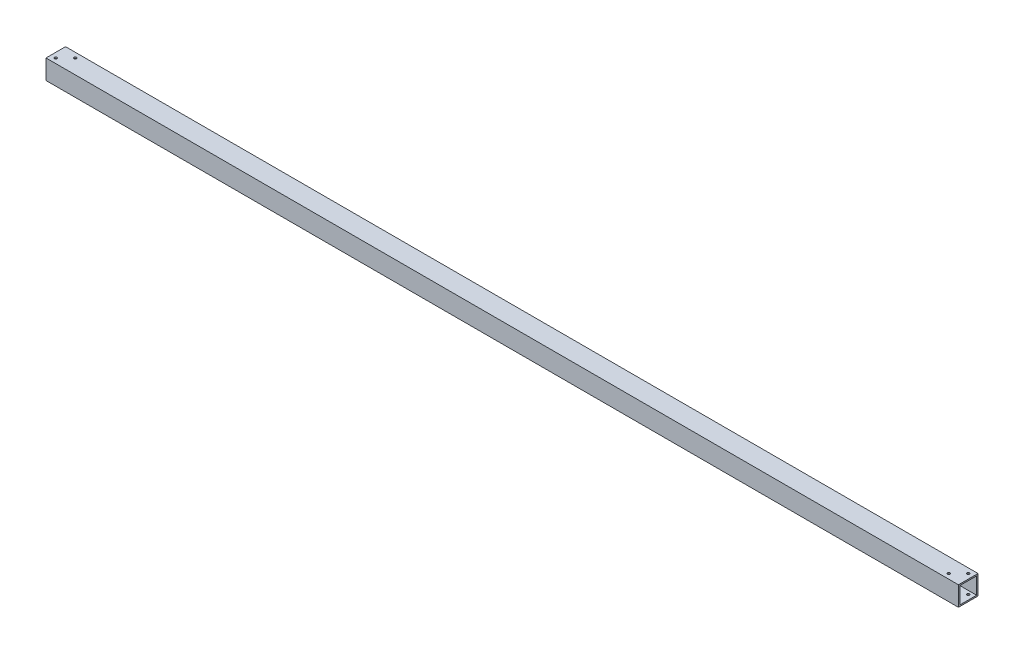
ISO-10303-21;
HEADER;
FILE_DESCRIPTION(('STEP AP214'),'2;1');
FILE_NAME('part.step','',(''),(''),'','','');
FILE_SCHEMA(('AUTOMOTIVE_DESIGN { 1 0 10303 214 1 1 1 1 }'));
ENDSEC;
DATA;
#1=APPLICATION_CONTEXT('core data for automotive mechanical design processes');
#2=APPLICATION_PROTOCOL_DEFINITION('international standard','automotive_design',2000,#1);
#3=PRODUCT_CONTEXT('',#1,'mechanical');
#4=PRODUCT('Part','Part','',(#3));
#5=PRODUCT_RELATED_PRODUCT_CATEGORY('part','',(#4));
#6=PRODUCT_DEFINITION_FORMATION('','',#4);
#7=PRODUCT_DEFINITION_CONTEXT('part definition',#1,'design');
#8=PRODUCT_DEFINITION('design','',#6,#7);
#9=PRODUCT_DEFINITION_SHAPE('','',#8);
#10=(LENGTH_UNIT() NAMED_UNIT(*) SI_UNIT(.MILLI.,.METRE.));
#11=(NAMED_UNIT(*) PLANE_ANGLE_UNIT() SI_UNIT($,.RADIAN.));
#12=(NAMED_UNIT(*) SI_UNIT($,.STERADIAN.) SOLID_ANGLE_UNIT());
#13=UNCERTAINTY_MEASURE_WITH_UNIT(LENGTH_MEASURE(1.E-05),#10,'distance_accuracy_value','');
#14=(GEOMETRIC_REPRESENTATION_CONTEXT(3) GLOBAL_UNCERTAINTY_ASSIGNED_CONTEXT((#13)) GLOBAL_UNIT_ASSIGNED_CONTEXT((#10,
#11,#12)) REPRESENTATION_CONTEXT('',''));
#15=CARTESIAN_POINT('',(0.,0.,0.));
#16=DIRECTION('',(0.,0.,1.));
#17=DIRECTION('',(1.,0.,0.));
#18=AXIS2_PLACEMENT_3D('',#15,#16,#17);
#19=CARTESIAN_POINT('',(2370.582,50.8,0.));
#20=DIRECTION('',(-1.,0.,0.));
#21=DIRECTION('',(0.,0.,1.));
#22=AXIS2_PLACEMENT_3D('',#19,#20,#21);
#23=PLANE('',#22);
#24=DIRECTION('',(0.,-1.,0.));
#25=VECTOR('',#24,1.);
#26=CARTESIAN_POINT('',(2370.582,0.,0.));
#27=LINE('',#26,#25);
#28=CARTESIAN_POINT('',(2370.582,50.8,0.));
#29=VERTEX_POINT('',#28);
#30=CARTESIAN_POINT('',(2370.582,0.,0.));
#31=VERTEX_POINT('',#30);
#32=EDGE_CURVE('E135',#29,#31,#27,.T.);
#33=ORIENTED_EDGE('',*,*,#32,.T.);
#34=DIRECTION('',(0.,0.,-1.));
#35=VECTOR('',#34,1.);
#36=CARTESIAN_POINT('',(2370.582,0.,0.));
#37=LINE('',#36,#35);
#38=CARTESIAN_POINT('',(2370.582,0.,-50.8));
#39=VERTEX_POINT('',#38);
#40=EDGE_CURVE('E138',#31,#39,#37,.T.);
#41=ORIENTED_EDGE('',*,*,#40,.T.);
#42=DIRECTION('',(0.,1.,0.));
#43=VECTOR('',#42,1.);
#44=CARTESIAN_POINT('',(2370.582,0.,-50.8));
#45=LINE('',#44,#43);
#46=CARTESIAN_POINT('',(2370.582,50.8,-50.8));
#47=VERTEX_POINT('',#46);
#48=EDGE_CURVE('E141',#39,#47,#45,.T.);
#49=ORIENTED_EDGE('',*,*,#48,.T.);
#50=DIRECTION('',(0.,0.,1.));
#51=VECTOR('',#50,1.);
#52=CARTESIAN_POINT('',(2370.582,50.8,0.));
#53=LINE('',#52,#51);
#54=EDGE_CURVE('E143',#47,#29,#53,.T.);
#55=ORIENTED_EDGE('',*,*,#54,.T.);
#56=EDGE_LOOP('',(#33,#41,#49,#55));
#57=FACE_BOUND('',#56,.T.);
#58=DIRECTION('',(0.,-1.,0.));
#59=VECTOR('',#58,1.);
#60=CARTESIAN_POINT('',(2370.582,47.1424,-3.6576));
#61=LINE('',#60,#59);
#62=CARTESIAN_POINT('',(2370.582,47.1424,-3.6576));
#63=VERTEX_POINT('',#62);
#64=CARTESIAN_POINT('',(2370.582,3.6576,-3.6576));
#65=VERTEX_POINT('',#64);
#66=EDGE_CURVE('E97',#63,#65,#61,.T.);
#67=ORIENTED_EDGE('',*,*,#66,.F.);
#68=DIRECTION('',(0.,0.,1.));
#69=VECTOR('',#68,1.);
#70=CARTESIAN_POINT('',(2370.582,47.1424,-3.6576));
#71=LINE('',#70,#69);
#72=CARTESIAN_POINT('',(2370.582,47.1424,-47.1424));
#73=VERTEX_POINT('',#72);
#74=EDGE_CURVE('E119',#73,#63,#71,.T.);
#75=ORIENTED_EDGE('',*,*,#74,.F.);
#76=DIRECTION('',(0.,1.,0.));
#77=VECTOR('',#76,1.);
#78=CARTESIAN_POINT('',(2370.582,47.1424,-47.1424));
#79=LINE('',#78,#77);
#80=CARTESIAN_POINT('',(2370.582,3.6576,-47.1424));
#81=VERTEX_POINT('',#80);
#82=EDGE_CURVE('E117',#81,#73,#79,.T.);
#83=ORIENTED_EDGE('',*,*,#82,.F.);
#84=DIRECTION('',(0.,0.,-1.));
#85=VECTOR('',#84,1.);
#86=CARTESIAN_POINT('',(2370.582,3.6576,-3.6576));
#87=LINE('',#86,#85);
#88=EDGE_CURVE('E105',#65,#81,#87,.T.);
#89=ORIENTED_EDGE('',*,*,#88,.F.);
#90=EDGE_LOOP('',(#67,#75,#83,#89));
#91=FACE_BOUND('',#90,.T.);
#92=ADVANCED_FACE('F30',(#57,#91),#23,.F.);
#93=CARTESIAN_POINT('',(0.,50.8,0.));
#94=DIRECTION('',(-1.,0.,0.));
#95=DIRECTION('',(0.,0.,1.));
#96=AXIS2_PLACEMENT_3D('',#93,#94,#95);
#97=PLANE('',#96);
#98=DIRECTION('',(0.,-1.,0.));
#99=VECTOR('',#98,1.);
#100=CARTESIAN_POINT('',(0.,0.,0.));
#101=LINE('',#100,#99);
#102=CARTESIAN_POINT('',(0.,50.8,0.));
#103=VERTEX_POINT('',#102);
#104=CARTESIAN_POINT('',(0.,0.,0.));
#105=VERTEX_POINT('',#104);
#106=EDGE_CURVE('E113',#103,#105,#101,.T.);
#107=ORIENTED_EDGE('',*,*,#106,.F.);
#108=DIRECTION('',(0.,0.,1.));
#109=VECTOR('',#108,1.);
#110=CARTESIAN_POINT('',(0.,50.8,0.));
#111=LINE('',#110,#109);
#112=CARTESIAN_POINT('',(0.,50.8,-50.8));
#113=VERTEX_POINT('',#112);
#114=EDGE_CURVE('E139',#113,#103,#111,.T.);
#115=ORIENTED_EDGE('',*,*,#114,.F.);
#116=DIRECTION('',(0.,1.,0.));
#117=VECTOR('',#116,1.);
#118=CARTESIAN_POINT('',(0.,0.,-50.8));
#119=LINE('',#118,#117);
#120=CARTESIAN_POINT('',(0.,0.,-50.8));
#121=VERTEX_POINT('',#120);
#122=EDGE_CURVE('E150',#121,#113,#119,.T.);
#123=ORIENTED_EDGE('',*,*,#122,.F.);
#124=DIRECTION('',(0.,0.,-1.));
#125=VECTOR('',#124,1.);
#126=CARTESIAN_POINT('',(0.,0.,0.));
#127=LINE('',#126,#125);
#128=EDGE_CURVE('E148',#105,#121,#127,.T.);
#129=ORIENTED_EDGE('',*,*,#128,.F.);
#130=EDGE_LOOP('',(#107,#115,#123,#129));
#131=FACE_BOUND('',#130,.T.);
#132=DIRECTION('',(0.,0.,1.));
#133=VECTOR('',#132,1.);
#134=CARTESIAN_POINT('',(0.,47.1424,-3.6576));
#135=LINE('',#134,#133);
#136=CARTESIAN_POINT('',(0.,47.1424,-47.1424));
#137=VERTEX_POINT('',#136);
#138=CARTESIAN_POINT('',(0.,47.1424,-3.6576));
#139=VERTEX_POINT('',#138);
#140=EDGE_CURVE('E106',#137,#139,#135,.T.);
#141=ORIENTED_EDGE('',*,*,#140,.T.);
#142=DIRECTION('',(0.,-1.,0.));
#143=VECTOR('',#142,1.);
#144=CARTESIAN_POINT('',(0.,47.1424,-3.6576));
#145=LINE('',#144,#143);
#146=CARTESIAN_POINT('',(0.,3.6576,-3.6576));
#147=VERTEX_POINT('',#146);
#148=EDGE_CURVE('E55',#139,#147,#145,.T.);
#149=ORIENTED_EDGE('',*,*,#148,.T.);
#150=DIRECTION('',(0.,0.,-1.));
#151=VECTOR('',#150,1.);
#152=CARTESIAN_POINT('',(0.,3.6576,-3.6576));
#153=LINE('',#152,#151);
#154=CARTESIAN_POINT('',(0.,3.6576,-47.1424));
#155=VERTEX_POINT('',#154);
#156=EDGE_CURVE('E112',#147,#155,#153,.T.);
#157=ORIENTED_EDGE('',*,*,#156,.T.);
#158=DIRECTION('',(0.,1.,0.));
#159=VECTOR('',#158,1.);
#160=CARTESIAN_POINT('',(0.,47.1424,-47.1424));
#161=LINE('',#160,#159);
#162=EDGE_CURVE('E127',#155,#137,#161,.T.);
#163=ORIENTED_EDGE('',*,*,#162,.T.);
#164=EDGE_LOOP('',(#141,#149,#157,#163));
#165=FACE_BOUND('',#164,.T.);
#166=ADVANCED_FACE('F220',(#131,#165),#97,.T.);
#167=CARTESIAN_POINT('',(2370.582,0.,0.));
#168=DIRECTION('',(0.,0.,-1.));
#169=DIRECTION('',(-1.,0.,0.));
#170=AXIS2_PLACEMENT_3D('',#167,#168,#169);
#171=PLANE('',#170);
#172=ORIENTED_EDGE('',*,*,#106,.T.);
#173=DIRECTION('',(-1.,0.,0.));
#174=VECTOR('',#173,1.);
#175=CARTESIAN_POINT('',(2370.582,0.,0.));
#176=LINE('',#175,#174);
#177=EDGE_CURVE('E11',#31,#105,#176,.T.);
#178=ORIENTED_EDGE('',*,*,#177,.F.);
#179=ORIENTED_EDGE('',*,*,#32,.F.);
#180=DIRECTION('',(-1.,0.,0.));
#181=VECTOR('',#180,1.);
#182=CARTESIAN_POINT('',(2370.582,50.8,0.));
#183=LINE('',#182,#181);
#184=EDGE_CURVE('E145',#29,#103,#183,.T.);
#185=ORIENTED_EDGE('',*,*,#184,.T.);
#186=EDGE_LOOP('',(#172,#178,#179,#185));
#187=FACE_BOUND('',#186,.T.);
#188=ADVANCED_FACE('F32',(#187),#171,.F.);
#189=CARTESIAN_POINT('',(2370.582,0.,0.));
#190=DIRECTION('',(0.,1.,0.));
#191=DIRECTION('',(0.,0.,1.));
#192=AXIS2_PLACEMENT_3D('',#189,#190,#191);
#193=PLANE('',#192);
#194=CARTESIAN_POINT('',(2332.482,0.,-12.7));
#195=DIRECTION('',(0.,1.,0.));
#196=DIRECTION('',(0.,0.,1.));
#197=AXIS2_PLACEMENT_3D('',#194,#195,#196);
#198=CIRCLE('',#197,3.3731200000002);
#199=CARTESIAN_POINT('',(2332.482,0.,-9.32687999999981));
#200=VERTEX_POINT('',#199);
#201=EDGE_CURVE('E244',#200,#200,#198,.T.);
#202=ORIENTED_EDGE('',*,*,#201,.T.);
#203=EDGE_LOOP('',(#202));
#204=FACE_BOUND('',#203,.T.);
#205=CARTESIAN_POINT('',(2357.882,0.,-38.1));
#206=DIRECTION('',(0.,1.,0.));
#207=DIRECTION('',(0.,0.,1.));
#208=AXIS2_PLACEMENT_3D('',#205,#206,#207);
#209=CIRCLE('',#208,3.37312000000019);
#210=CARTESIAN_POINT('',(2357.882,0.,-34.7268799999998));
#211=VERTEX_POINT('',#210);
#212=EDGE_CURVE('E171',#211,#211,#209,.T.);
#213=ORIENTED_EDGE('',*,*,#212,.T.);
#214=EDGE_LOOP('',(#213));
#215=FACE_BOUND('',#214,.T.);
#216=CARTESIAN_POINT('',(38.1,0.,-38.1));
#217=DIRECTION('',(0.,1.,0.));
#218=DIRECTION('',(0.,0.,1.));
#219=AXIS2_PLACEMENT_3D('',#216,#217,#218);
#220=CIRCLE('',#219,3.37312);
#221=CARTESIAN_POINT('',(38.1,0.,-34.72688));
#222=VERTEX_POINT('',#221);
#223=EDGE_CURVE('E167',#222,#222,#220,.T.);
#224=ORIENTED_EDGE('',*,*,#223,.T.);
#225=EDGE_LOOP('',(#224));
#226=FACE_BOUND('',#225,.T.);
#227=CARTESIAN_POINT('',(12.7,0.,-12.7));
#228=DIRECTION('',(0.,1.,0.));
#229=DIRECTION('',(0.,0.,1.));
#230=AXIS2_PLACEMENT_3D('',#227,#228,#229);
#231=CIRCLE('',#230,3.37312);
#232=CARTESIAN_POINT('',(12.7,0.,-9.32688));
#233=VERTEX_POINT('',#232);
#234=EDGE_CURVE('E163',#233,#233,#231,.T.);
#235=ORIENTED_EDGE('',*,*,#234,.T.);
#236=EDGE_LOOP('',(#235));
#237=FACE_BOUND('',#236,.T.);
#238=ORIENTED_EDGE('',*,*,#128,.T.);
#239=DIRECTION('',(-1.,0.,0.));
#240=VECTOR('',#239,1.);
#241=CARTESIAN_POINT('',(2370.582,0.,-50.8));
#242=LINE('',#241,#240);
#243=EDGE_CURVE('E39',#39,#121,#242,.T.);
#244=ORIENTED_EDGE('',*,*,#243,.F.);
#245=ORIENTED_EDGE('',*,*,#40,.F.);
#246=ORIENTED_EDGE('',*,*,#177,.T.);
#247=EDGE_LOOP('',(#238,#244,#245,#246));
#248=FACE_BOUND('',#247,.T.);
#249=ADVANCED_FACE('F234',(#204,#215,#226,#237,#248),#193,.F.);
#250=CARTESIAN_POINT('',(2370.582,0.,-50.8));
#251=DIRECTION('',(0.,0.,1.));
#252=DIRECTION('',(1.,0.,0.));
#253=AXIS2_PLACEMENT_3D('',#250,#251,#252);
#254=PLANE('',#253);
#255=ORIENTED_EDGE('',*,*,#122,.T.);
#256=DIRECTION('',(-1.,0.,0.));
#257=VECTOR('',#256,1.);
#258=CARTESIAN_POINT('',(2370.582,50.8,-50.8));
#259=LINE('',#258,#257);
#260=EDGE_CURVE('E155',#47,#113,#259,.T.);
#261=ORIENTED_EDGE('',*,*,#260,.F.);
#262=ORIENTED_EDGE('',*,*,#48,.F.);
#263=ORIENTED_EDGE('',*,*,#243,.T.);
#264=EDGE_LOOP('',(#255,#261,#262,#263));
#265=FACE_BOUND('',#264,.T.);
#266=ADVANCED_FACE('F231',(#265),#254,.F.);
#267=CARTESIAN_POINT('',(2370.582,50.8,0.));
#268=DIRECTION('',(0.,-1.,0.));
#269=DIRECTION('',(0.,0.,-1.));
#270=AXIS2_PLACEMENT_3D('',#267,#268,#269);
#271=PLANE('',#270);
#272=CARTESIAN_POINT('',(2332.482,50.8,-12.7));
#273=DIRECTION('',(0.,1.,0.));
#274=DIRECTION('',(0.,0.,1.));
#275=AXIS2_PLACEMENT_3D('',#272,#273,#274);
#276=CIRCLE('',#275,3.3731200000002);
#277=CARTESIAN_POINT('',(2332.482,50.8,-9.32687999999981));
#278=VERTEX_POINT('',#277);
#279=EDGE_CURVE('E298',#278,#278,#276,.T.);
#280=ORIENTED_EDGE('',*,*,#279,.F.);
#281=EDGE_LOOP('',(#280));
#282=FACE_BOUND('',#281,.T.);
#283=CARTESIAN_POINT('',(2357.882,50.8,-38.1));
#284=DIRECTION('',(0.,1.,0.));
#285=DIRECTION('',(0.,0.,1.));
#286=AXIS2_PLACEMENT_3D('',#283,#284,#285);
#287=CIRCLE('',#286,3.37312000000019);
#288=CARTESIAN_POINT('',(2357.882,50.8,-34.7268799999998));
#289=VERTEX_POINT('',#288);
#290=EDGE_CURVE('E178',#289,#289,#287,.T.);
#291=ORIENTED_EDGE('',*,*,#290,.F.);
#292=EDGE_LOOP('',(#291));
#293=FACE_BOUND('',#292,.T.);
#294=CARTESIAN_POINT('',(38.1,50.8,-38.1));
#295=DIRECTION('',(0.,1.,0.));
#296=DIRECTION('',(0.,0.,1.));
#297=AXIS2_PLACEMENT_3D('',#294,#295,#296);
#298=CIRCLE('',#297,3.37312);
#299=CARTESIAN_POINT('',(38.1,50.8,-34.72688));
#300=VERTEX_POINT('',#299);
#301=EDGE_CURVE('E175',#300,#300,#298,.T.);
#302=ORIENTED_EDGE('',*,*,#301,.F.);
#303=EDGE_LOOP('',(#302));
#304=FACE_BOUND('',#303,.T.);
#305=CARTESIAN_POINT('',(12.7,50.8,-12.7));
#306=DIRECTION('',(0.,1.,0.));
#307=DIRECTION('',(0.,0.,1.));
#308=AXIS2_PLACEMENT_3D('',#305,#306,#307);
#309=CIRCLE('',#308,3.37312);
#310=CARTESIAN_POINT('',(12.7,50.8,-9.32688));
#311=VERTEX_POINT('',#310);
#312=EDGE_CURVE('E194',#311,#311,#309,.T.);
#313=ORIENTED_EDGE('',*,*,#312,.F.);
#314=EDGE_LOOP('',(#313));
#315=FACE_BOUND('',#314,.T.);
#316=ORIENTED_EDGE('',*,*,#114,.T.);
#317=ORIENTED_EDGE('',*,*,#184,.F.);
#318=ORIENTED_EDGE('',*,*,#54,.F.);
#319=ORIENTED_EDGE('',*,*,#260,.T.);
#320=EDGE_LOOP('',(#316,#317,#318,#319));
#321=FACE_BOUND('',#320,.T.);
#322=ADVANCED_FACE('F215',(#282,#293,#304,#315,#321),#271,.F.);
#323=CARTESIAN_POINT('',(2370.582,47.1424,-3.6576));
#324=DIRECTION('',(0.,0.,-1.));
#325=DIRECTION('',(0.,1.,0.));
#326=AXIS2_PLACEMENT_3D('',#323,#324,#325);
#327=PLANE('',#326);
#328=ORIENTED_EDGE('',*,*,#148,.F.);
#329=DIRECTION('',(-1.,0.,0.));
#330=VECTOR('',#329,1.);
#331=CARTESIAN_POINT('',(2370.582,47.1424,-3.6576));
#332=LINE('',#331,#330);
#333=EDGE_CURVE('E101',#63,#139,#332,.T.);
#334=ORIENTED_EDGE('',*,*,#333,.F.);
#335=ORIENTED_EDGE('',*,*,#66,.T.);
#336=DIRECTION('',(-1.,0.,0.));
#337=VECTOR('',#336,1.);
#338=CARTESIAN_POINT('',(2370.582,3.6576,-3.6576));
#339=LINE('',#338,#337);
#340=EDGE_CURVE('E100',#65,#147,#339,.T.);
#341=ORIENTED_EDGE('',*,*,#340,.T.);
#342=EDGE_LOOP('',(#328,#334,#335,#341));
#343=FACE_BOUND('',#342,.T.);
#344=ADVANCED_FACE('F99',(#343),#327,.T.);
#345=CARTESIAN_POINT('',(2370.582,3.6576,-3.6576));
#346=DIRECTION('',(0.,1.,0.));
#347=DIRECTION('',(0.,0.,1.));
#348=AXIS2_PLACEMENT_3D('',#345,#346,#347);
#349=PLANE('',#348);
#350=CARTESIAN_POINT('',(2332.482,3.6576,-12.7));
#351=DIRECTION('',(0.,1.,0.));
#352=DIRECTION('',(0.,0.,1.));
#353=AXIS2_PLACEMENT_3D('',#350,#351,#352);
#354=CIRCLE('',#353,3.3731200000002);
#355=CARTESIAN_POINT('',(2332.482,3.6576,-9.32687999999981));
#356=VERTEX_POINT('',#355);
#357=EDGE_CURVE('E183',#356,#356,#354,.T.);
#358=ORIENTED_EDGE('',*,*,#357,.F.);
#359=EDGE_LOOP('',(#358));
#360=FACE_BOUND('',#359,.T.);
#361=CARTESIAN_POINT('',(2357.882,3.6576,-38.1));
#362=DIRECTION('',(0.,1.,0.));
#363=DIRECTION('',(0.,0.,1.));
#364=AXIS2_PLACEMENT_3D('',#361,#362,#363);
#365=CIRCLE('',#364,3.37312000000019);
#366=CARTESIAN_POINT('',(2357.882,3.6576,-34.7268799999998));
#367=VERTEX_POINT('',#366);
#368=EDGE_CURVE('E170',#367,#367,#365,.T.);
#369=ORIENTED_EDGE('',*,*,#368,.F.);
#370=EDGE_LOOP('',(#369));
#371=FACE_BOUND('',#370,.T.);
#372=CARTESIAN_POINT('',(38.1,3.6576,-38.1));
#373=DIRECTION('',(0.,1.,0.));
#374=DIRECTION('',(0.,0.,1.));
#375=AXIS2_PLACEMENT_3D('',#372,#373,#374);
#376=CIRCLE('',#375,3.37312);
#377=CARTESIAN_POINT('',(38.1,3.6576,-34.72688));
#378=VERTEX_POINT('',#377);
#379=EDGE_CURVE('E166',#378,#378,#376,.T.);
#380=ORIENTED_EDGE('',*,*,#379,.F.);
#381=EDGE_LOOP('',(#380));
#382=FACE_BOUND('',#381,.T.);
#383=CARTESIAN_POINT('',(12.7,3.6576,-12.7));
#384=DIRECTION('',(0.,1.,0.));
#385=DIRECTION('',(0.,0.,1.));
#386=AXIS2_PLACEMENT_3D('',#383,#384,#385);
#387=CIRCLE('',#386,3.37312);
#388=CARTESIAN_POINT('',(12.7,3.6576,-9.32688));
#389=VERTEX_POINT('',#388);
#390=EDGE_CURVE('E125',#389,#389,#387,.T.);
#391=ORIENTED_EDGE('',*,*,#390,.F.);
#392=EDGE_LOOP('',(#391));
#393=FACE_BOUND('',#392,.T.);
#394=ORIENTED_EDGE('',*,*,#156,.F.);
#395=ORIENTED_EDGE('',*,*,#340,.F.);
#396=ORIENTED_EDGE('',*,*,#88,.T.);
#397=DIRECTION('',(-1.,0.,0.));
#398=VECTOR('',#397,1.);
#399=CARTESIAN_POINT('',(2370.582,3.6576,-47.1424));
#400=LINE('',#399,#398);
#401=EDGE_CURVE('E114',#81,#155,#400,.T.);
#402=ORIENTED_EDGE('',*,*,#401,.T.);
#403=EDGE_LOOP('',(#394,#395,#396,#402));
#404=FACE_BOUND('',#403,.T.);
#405=ADVANCED_FACE('F109',(#360,#371,#382,#393,#404),#349,.T.);
#406=CARTESIAN_POINT('',(2370.582,47.1424,-47.1424));
#407=DIRECTION('',(0.,0.,1.));
#408=DIRECTION('',(0.,-1.,0.));
#409=AXIS2_PLACEMENT_3D('',#406,#407,#408);
#410=PLANE('',#409);
#411=ORIENTED_EDGE('',*,*,#162,.F.);
#412=ORIENTED_EDGE('',*,*,#401,.F.);
#413=ORIENTED_EDGE('',*,*,#82,.T.);
#414=DIRECTION('',(-1.,0.,0.));
#415=VECTOR('',#414,1.);
#416=CARTESIAN_POINT('',(2370.582,47.1424,-47.1424));
#417=LINE('',#416,#415);
#418=EDGE_CURVE('E47',#73,#137,#417,.T.);
#419=ORIENTED_EDGE('',*,*,#418,.T.);
#420=EDGE_LOOP('',(#411,#412,#413,#419));
#421=FACE_BOUND('',#420,.T.);
#422=ADVANCED_FACE('F205',(#421),#410,.T.);
#423=CARTESIAN_POINT('',(2370.582,47.1424,-3.6576));
#424=DIRECTION('',(0.,-1.,0.));
#425=DIRECTION('',(0.,0.,-1.));
#426=AXIS2_PLACEMENT_3D('',#423,#424,#425);
#427=PLANE('',#426);
#428=CARTESIAN_POINT('',(2332.482,47.1424,-12.7));
#429=DIRECTION('',(0.,-1.,0.));
#430=DIRECTION('',(0.,0.,-1.));
#431=AXIS2_PLACEMENT_3D('',#428,#429,#430);
#432=CIRCLE('',#431,3.3731200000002);
#433=CARTESIAN_POINT('',(2332.482,47.1424,-16.0731200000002));
#434=VERTEX_POINT('',#433);
#435=EDGE_CURVE('E34',#434,#434,#432,.T.);
#436=ORIENTED_EDGE('',*,*,#435,.F.);
#437=EDGE_LOOP('',(#436));
#438=FACE_BOUND('',#437,.T.);
#439=CARTESIAN_POINT('',(2357.882,47.1424,-38.1));
#440=DIRECTION('',(0.,-1.,0.));
#441=DIRECTION('',(0.,0.,-1.));
#442=AXIS2_PLACEMENT_3D('',#439,#440,#441);
#443=CIRCLE('',#442,3.37312000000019);
#444=CARTESIAN_POINT('',(2357.882,47.1424,-41.4731200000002));
#445=VERTEX_POINT('',#444);
#446=EDGE_CURVE('E168',#445,#445,#443,.T.);
#447=ORIENTED_EDGE('',*,*,#446,.F.);
#448=EDGE_LOOP('',(#447));
#449=FACE_BOUND('',#448,.T.);
#450=CARTESIAN_POINT('',(38.1,47.1424,-38.1));
#451=DIRECTION('',(0.,-1.,0.));
#452=DIRECTION('',(0.,0.,-1.));
#453=AXIS2_PLACEMENT_3D('',#450,#451,#452);
#454=CIRCLE('',#453,3.37312);
#455=CARTESIAN_POINT('',(38.1,47.1424,-41.47312));
#456=VERTEX_POINT('',#455);
#457=EDGE_CURVE('E164',#456,#456,#454,.T.);
#458=ORIENTED_EDGE('',*,*,#457,.F.);
#459=EDGE_LOOP('',(#458));
#460=FACE_BOUND('',#459,.T.);
#461=CARTESIAN_POINT('',(12.7,47.1424,-12.7));
#462=DIRECTION('',(0.,-1.,0.));
#463=DIRECTION('',(0.,0.,-1.));
#464=AXIS2_PLACEMENT_3D('',#461,#462,#463);
#465=CIRCLE('',#464,3.37312);
#466=CARTESIAN_POINT('',(12.7,47.1424,-16.07312));
#467=VERTEX_POINT('',#466);
#468=EDGE_CURVE('E160',#467,#467,#465,.T.);
#469=ORIENTED_EDGE('',*,*,#468,.F.);
#470=EDGE_LOOP('',(#469));
#471=FACE_BOUND('',#470,.T.);
#472=ORIENTED_EDGE('',*,*,#140,.F.);
#473=ORIENTED_EDGE('',*,*,#418,.F.);
#474=ORIENTED_EDGE('',*,*,#74,.T.);
#475=ORIENTED_EDGE('',*,*,#333,.T.);
#476=EDGE_LOOP('',(#472,#473,#474,#475));
#477=FACE_BOUND('',#476,.T.);
#478=ADVANCED_FACE('F212',(#438,#449,#460,#471,#477),#427,.T.);
#479=CARTESIAN_POINT('',(12.7,0.,-12.7));
#480=DIRECTION('',(0.,1.,0.));
#481=DIRECTION('',(0.,0.,1.));
#482=AXIS2_PLACEMENT_3D('',#479,#480,#481);
#483=CYLINDRICAL_SURFACE('',#482,3.37312);
#484=ORIENTED_EDGE('',*,*,#468,.T.);
#485=EDGE_LOOP('',(#484));
#486=FACE_BOUND('',#485,.T.);
#487=ORIENTED_EDGE('',*,*,#312,.T.);
#488=EDGE_LOOP('',(#487));
#489=FACE_BOUND('',#488,.T.);
#490=ADVANCED_FACE('F264',(#486,#489),#483,.F.);
#491=ORIENTED_EDGE('',*,*,#390,.T.);
#492=EDGE_LOOP('',(#491));
#493=FACE_BOUND('',#492,.T.);
#494=ORIENTED_EDGE('',*,*,#234,.F.);
#495=EDGE_LOOP('',(#494));
#496=FACE_BOUND('',#495,.T.);
#497=ADVANCED_FACE('F201',(#493,#496),#483,.F.);
#498=CARTESIAN_POINT('',(38.1,0.,-38.1));
#499=DIRECTION('',(0.,1.,0.));
#500=DIRECTION('',(0.,0.,1.));
#501=AXIS2_PLACEMENT_3D('',#498,#499,#500);
#502=CYLINDRICAL_SURFACE('',#501,3.37312);
#503=ORIENTED_EDGE('',*,*,#457,.T.);
#504=EDGE_LOOP('',(#503));
#505=FACE_BOUND('',#504,.T.);
#506=ORIENTED_EDGE('',*,*,#301,.T.);
#507=EDGE_LOOP('',(#506));
#508=FACE_BOUND('',#507,.T.);
#509=ADVANCED_FACE('F275',(#505,#508),#502,.F.);
#510=ORIENTED_EDGE('',*,*,#379,.T.);
#511=EDGE_LOOP('',(#510));
#512=FACE_BOUND('',#511,.T.);
#513=ORIENTED_EDGE('',*,*,#223,.F.);
#514=EDGE_LOOP('',(#513));
#515=FACE_BOUND('',#514,.T.);
#516=ADVANCED_FACE('F278',(#512,#515),#502,.F.);
#517=CARTESIAN_POINT('',(2357.882,0.,-38.1));
#518=DIRECTION('',(0.,1.,0.));
#519=DIRECTION('',(0.,0.,1.));
#520=AXIS2_PLACEMENT_3D('',#517,#518,#519);
#521=CYLINDRICAL_SURFACE('',#520,3.37312000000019);
#522=ORIENTED_EDGE('',*,*,#446,.T.);
#523=EDGE_LOOP('',(#522));
#524=FACE_BOUND('',#523,.T.);
#525=ORIENTED_EDGE('',*,*,#290,.T.);
#526=EDGE_LOOP('',(#525));
#527=FACE_BOUND('',#526,.T.);
#528=ADVANCED_FACE('F280',(#524,#527),#521,.F.);
#529=ORIENTED_EDGE('',*,*,#368,.T.);
#530=EDGE_LOOP('',(#529));
#531=FACE_BOUND('',#530,.T.);
#532=ORIENTED_EDGE('',*,*,#212,.F.);
#533=EDGE_LOOP('',(#532));
#534=FACE_BOUND('',#533,.T.);
#535=ADVANCED_FACE('F283',(#531,#534),#521,.F.);
#536=CARTESIAN_POINT('',(2332.482,0.,-12.7));
#537=DIRECTION('',(0.,1.,0.));
#538=DIRECTION('',(0.,0.,1.));
#539=AXIS2_PLACEMENT_3D('',#536,#537,#538);
#540=CYLINDRICAL_SURFACE('',#539,3.3731200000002);
#541=ORIENTED_EDGE('',*,*,#435,.T.);
#542=EDGE_LOOP('',(#541));
#543=FACE_BOUND('',#542,.T.);
#544=ORIENTED_EDGE('',*,*,#279,.T.);
#545=EDGE_LOOP('',(#544));
#546=FACE_BOUND('',#545,.T.);
#547=ADVANCED_FACE('F284',(#543,#546),#540,.F.);
#548=ORIENTED_EDGE('',*,*,#357,.T.);
#549=EDGE_LOOP('',(#548));
#550=FACE_BOUND('',#549,.T.);
#551=ORIENTED_EDGE('',*,*,#201,.F.);
#552=EDGE_LOOP('',(#551));
#553=FACE_BOUND('',#552,.T.);
#554=ADVANCED_FACE('F286',(#550,#553),#540,.F.);
#555=CLOSED_SHELL('',(#92,#166,#188,#249,#266,#322,#344,#405,#422,#478,#490,#497,#509,#516,#528,
#535,#547,#554));
#556=MANIFOLD_SOLID_BREP('B2',#555);
#557=ADVANCED_BREP_SHAPE_REPRESENTATION('',(#18,#556),#14);
#558=SHAPE_DEFINITION_REPRESENTATION(#9,#557);
ENDSEC;
END-ISO-10303-21;
